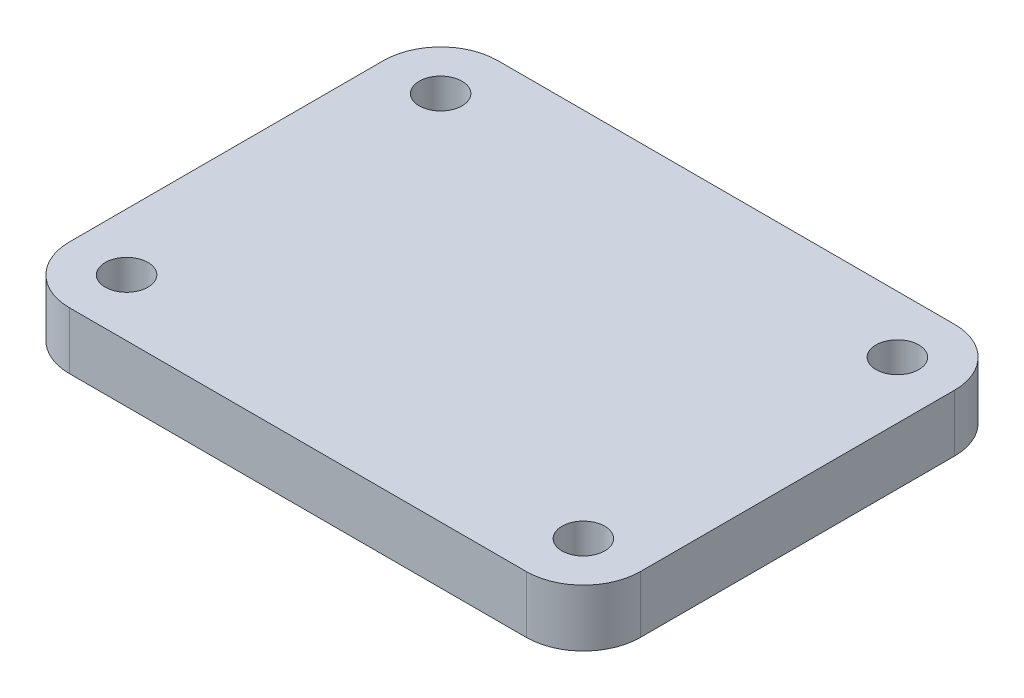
from build123d import *

# Parameters (mm, degrees)
SKETCH1_W            = 200
SKETCH1_H            = 150
EXTRUDE1_DEPTH       = 20
FILLET1_R            = 20
HOLE1_D              = 15
LPATTERN1_COUNT      = 2
LPATTERN1_PITCH      = 160
LPATTERN1_COUNT_DIR2 = 2
LPATTERN1_PITCH_DIR2 = 110


with BuildPart() as part:
    # Sketch1 → Extrude1 (new body)
    with BuildSketch(Plane(origin=(0, 0, 0), x_dir=(1, 0, 0), z_dir=(0, 1, 0))):
        Rectangle(SKETCH1_W, SKETCH1_H)
    extrude(amount=EXTRUDE1_DEPTH)

    # Fillet1
    fillet1_edges = [part.edges().sort_by_distance(p)[0] for p in [
        (-100, 10, -75),
        (100, 10, -75),
        (100, 10, 75),
        (-100, 10, 75),
    ]]
    fillet(fillet1_edges, radius=FILLET1_R)

    # Hole1 (through all)
    with Locations(Plane(origin=(-80, 20, 55), x_dir=(0, 0, 1), z_dir=(0, 1, 0))):
        with Locations((0, 0)):
            hole1 = Hole(HOLE1_D / 2)

    # LPattern1: Hole1 2 × 2
    with Locations(*[(i * LPATTERN1_PITCH, 0, -j * LPATTERN1_PITCH_DIR2) for i in range(LPATTERN1_COUNT) for j in range(LPATTERN1_COUNT_DIR2) if (i, j) != (0, 0)]):
        add(hole1, mode=Mode.SUBTRACT)


solid = part.part
